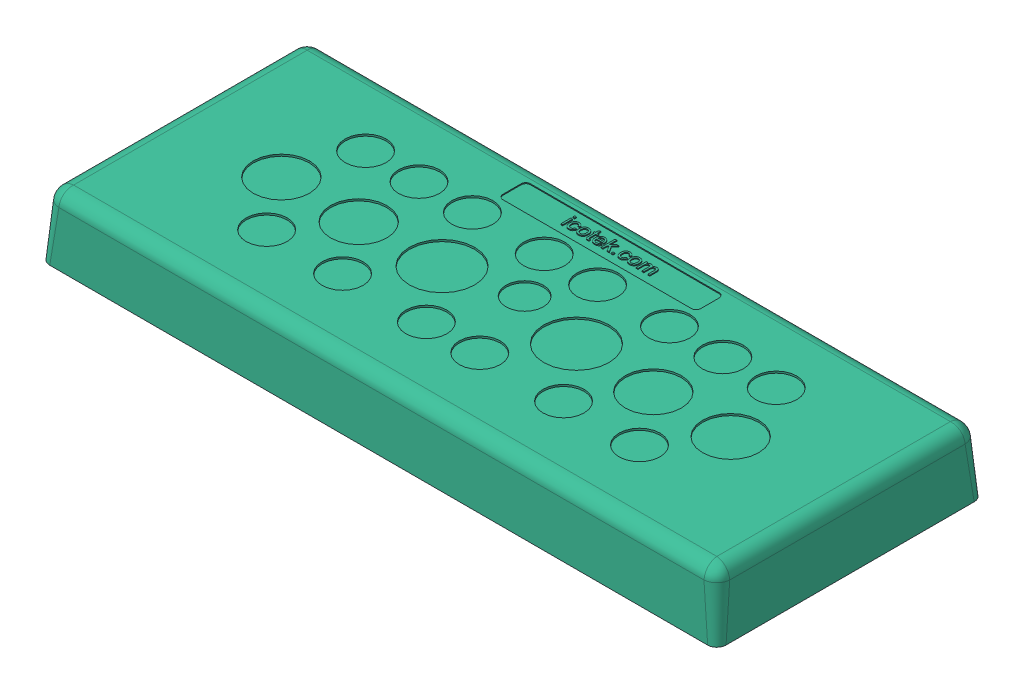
SolidWorks assembly 73930.SLDASM, configuration Default (file format 8000). Lengths in mm.
Overall size (146.92 24.6 57.92).
27 component instances, 27 part files, 0 mates.
Components (placement in the parent):
- 73930_01-1: 73930_01.SLDPRT [Default] at origin size (7.87 1.25 7.87)
- 73930_02-1: 73930_02.SLDPRT [Default] at origin size (8.67 1.25 8.67)
- 73930_03-1: 73930_03.SLDPRT [Default] at origin size (8.67 1.25 8.67)
- 73930_04-1: 73930_04.SLDPRT [Default] at origin size (8.67 1.25 8.67)
- 73930_05-1: 73930_05.SLDPRT [Default] at origin size (8.67 1.25 8.67)
- 73930_06-1: 73930_06.SLDPRT [Default] at origin size (146.92 24.6 57.92)
- 73930_07-1: 73930_07.SLDPRT [Default] at origin size (8.67 1.25 8.67)
- 73930_08-1: 73930_08.SLDPRT [Default] at origin size (8.67 1.25 8.67)
- 73930_09-1: 73930_09.SLDPRT [Default] at origin size (4.98 0.91 5.14)
- 73930_10-1: 73930_10.SLDPRT [Default] at origin size (8.67 1.25 8.67)
- 73930_11-1: 73930_11.SLDPRT [Default] at origin size (12.17 1.25 12.17)
- 73930_12-1: 73930_12.SLDPRT [Default] at origin size (11.33 0.91 10.62)
- 73930_13-1: 73930_13.SLDPRT [Default] at origin size (8.67 1.25 8.67)
- 73930_14-1: 73930_14.SLDPRT [Default] at origin size (4.78 0.91 3.33)
- 73930_15-1: 73930_15.SLDPRT [Default] at origin size (12.17 1.25 12.17)
- 73930_16-1: 73930_16.SLDPRT [Default] at origin size (8.67 1.25 8.67)
- 73930_17-1: 73930_17.SLDPRT [Default] at origin size (12.17 1.25 12.17)
- 73930_18-1: 73930_18.SLDPRT [Default] at origin size (8.67 1.25 8.67)
- 73930_19-1: 73930_19.SLDPRT [Default] at origin size (8.67 1.25 8.67)
- 73930_20-1: 73930_20.SLDPRT [Default] at origin size (14.16 1.25 14.16)
- 73930_21-1: 73930_21.SLDPRT [Default] at origin size (5.18 0.91 5.33)
- 73930_22-1: 73930_22.SLDPRT [Default] at origin size (8.67 1.25 8.67)
- 73930_23-1: 73930_23.SLDPRT [Default] at origin size (8.67 1.25 8.67)
- 73930_24-1: 73930_24.SLDPRT [Default] at origin size (11.23 0.91 10.62)
- 73930_25-1: 73930_25.SLDPRT [Default] at origin size (8.67 1.25 8.67)
- 73930_26-1: 73930_26.SLDPRT [Default] at origin size (12.17 1.25 12.17)
- 73930_27-1: 73930_27.SLDPRT [Default] at origin size (14.16 1.25 14.16)
